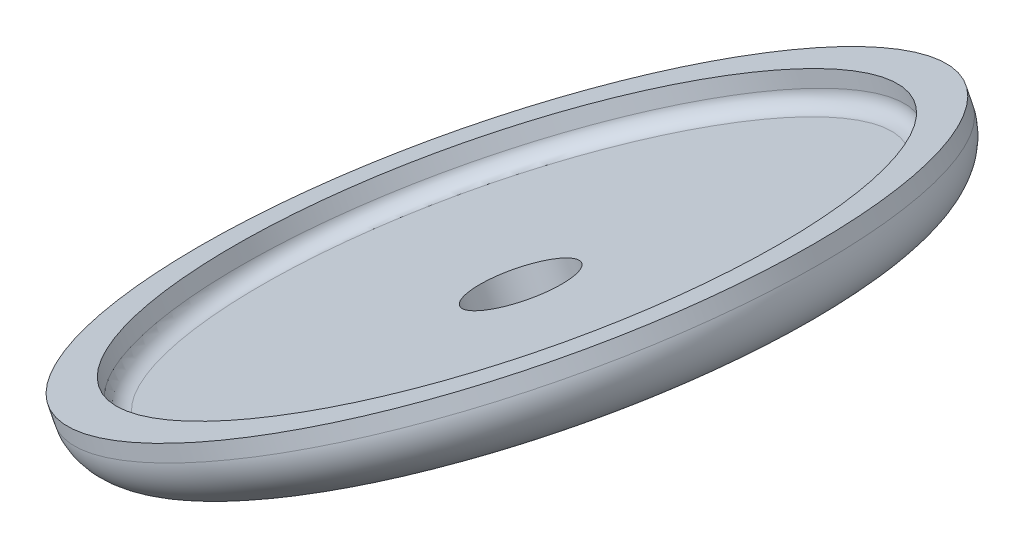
from build123d import *


with BuildPart() as part:
    # Esquisse1 → R_volution1 (revolve)
    with BuildSketch(Plane.XY):
        with BuildLine():
            Line((-14.396226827, 112.263796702), (0.343934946, 119.678486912))
            ThreePointArc((0.343934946, 119.678486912), (1.844145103, 121.416718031), (1.675838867, 123.706641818))
            Line((1.675838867, 123.706641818), (1.226463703, 124.599984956))
            Line((1.226463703, 124.599984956), (-1.006894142, 123.476547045))
            Line((-1.006894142, 123.476547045), (-0.557518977, 122.583203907))
            ThreePointArc((-0.557518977, 122.583203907), (-0.501416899, 121.819895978), (-1.001486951, 121.240485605))
            Line((-1.001486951, 121.240485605), (-15.294977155, 114.050482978))
            Line((-15.294977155, 114.050482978), (-14.396226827, 112.263796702))
        make_face()
    revolve(axis=Axis((18.873756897, 39.448220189, 0), (-0.44937516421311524, 0.8933431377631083, 0)))


solid = part.part
